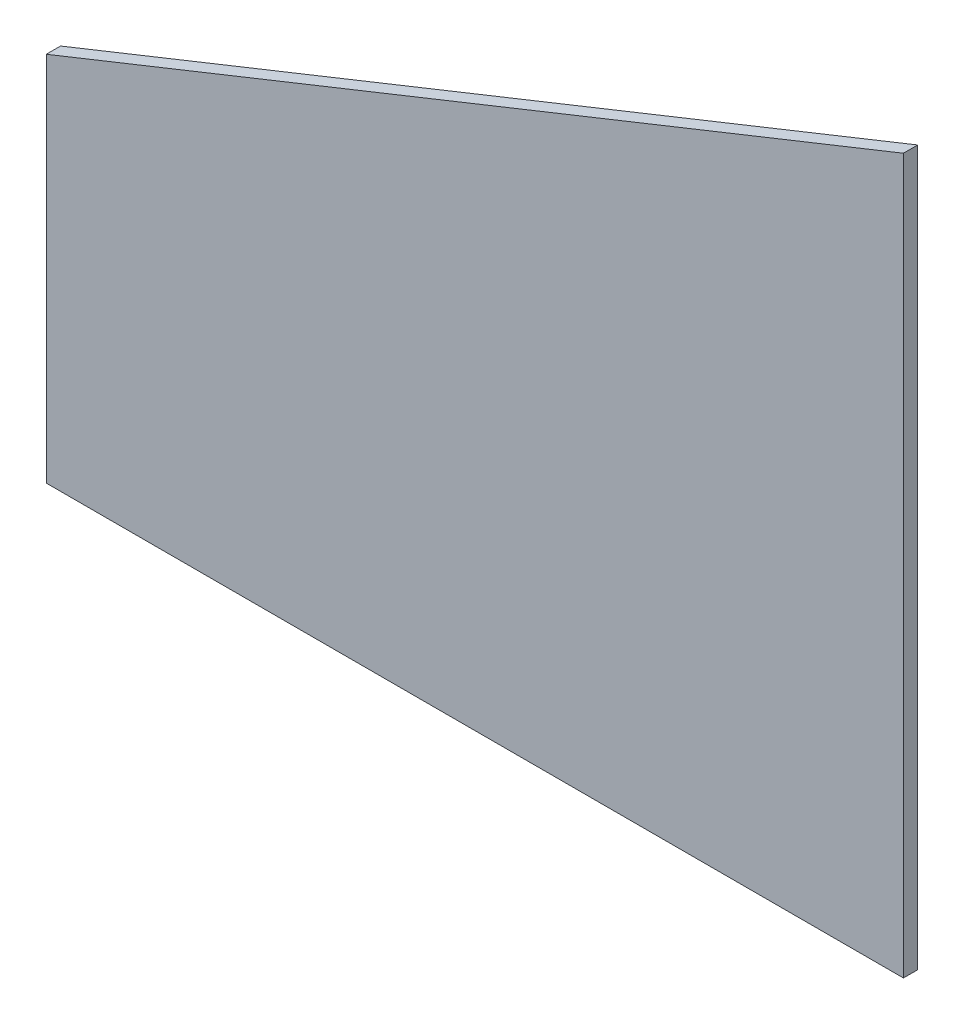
from build123d import *


with BuildPart() as part:
    # Sketch1 → Tapered_plywood_panel section 0
    with BuildSketch(Plane.YZ):
        with BuildLine():
            Line((-82.55, -82.55), (82.55, -82.55))
            Line((82.55, -82.55), (82.55, -76.2))
            Line((82.55, -76.2), (-82.55, -76.2))
            Line((-82.55, -76.2), (-82.55, -82.55))
        make_face()
    # Sketch2 → Tapered_plywood_panel section 1
    with BuildSketch(Plane.YZ.offset(304.8)):
        with BuildLine():
            Line((-158.75, -158.75), (158.75, -158.75))
            Line((158.75, -158.75), (158.75, -152.4))
            Line((158.75, -152.4), (-158.75, -152.4))
            Line((-158.75, -152.4), (-158.75, -158.75))
        make_face()
    loft()


solid = part.part
